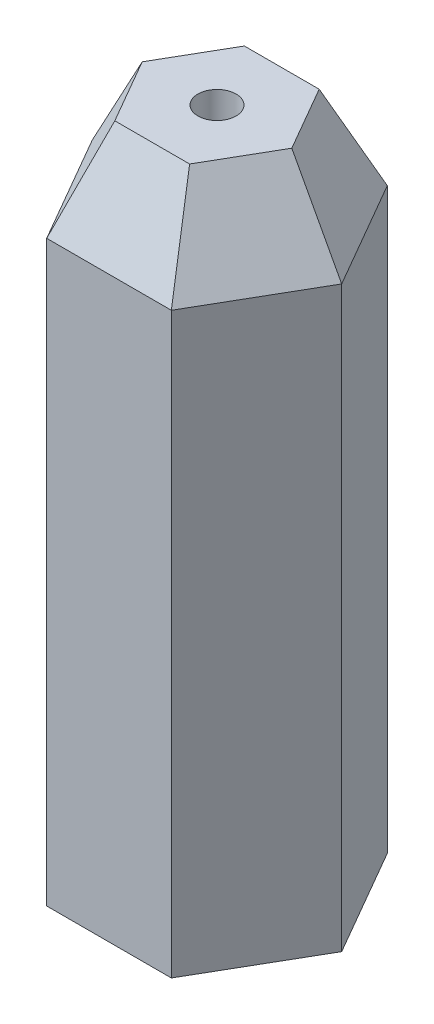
from build123d import *

# Parameters (mm, degrees)
SKETCH1_R           = 1.325
BOSS_EXTRUDE1_DEPTH = 46.6
BOSS_EXTRUDE2_START = -34.6
SKETCH2_R           = 1.325
BOSS_EXTRUDE2_DEPTH = 22.6
CHAMFER1_SIZE       = 3
CHAMFER1_SIZE2      = 6.433520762


with BuildPart() as part:
    # Sketch1 → Boss-Extrude1 (new body)
    with BuildSketch(Plane(origin=(0, 0, 0), x_dir=(1, 0, 0), z_dir=(0, 1, 0))):
        Polygon((-8.660254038, 0), (-4.330127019, -7.5), (4.330127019, -7.5), (8.660254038, 0), (4.330127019, 7.5), (-4.330127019, 7.5), align=None)
        with Locations(Location((0, 0, 0), (0, 0, 270))):
            Circle(SKETCH1_R, mode=Mode.SUBTRACT)
    extrude(amount=BOSS_EXTRUDE1_DEPTH)

    # Sketch2 → Boss-Extrude2 (add)
    with BuildSketch(Plane(origin=(0, 46.6, 0), x_dir=(1, 0, 0), z_dir=(0, 1, 0)).offset(BOSS_EXTRUDE2_START)):
        with Locations(Location((0, 0, 0), (0, 0, 270))):
            Circle(SKETCH2_R)
    extrude(amount=BOSS_EXTRUDE2_DEPTH)

    # Chamfer1
    chamfer1_edges = [part.edges().sort_by_distance(p)[0] for p in [
        (0, 46.6, 7.5),
        (6.495190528, 46.6, 3.75),
        (6.495190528, 46.6, -3.75),
        (0, 46.6, -7.5),
        (-6.495190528, 46.6, -3.75),
        (-6.495190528, 46.6, 3.75),
    ]]
    chamfer1_side = [part.faces().sort_by_distance(p)[0] for p in [
        (-6.29675918, 46.6, 3.635435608),
    ]]
    chamfer(chamfer1_edges, length=CHAMFER1_SIZE, length2=CHAMFER1_SIZE2, reference=chamfer1_side[0])


solid = part.part
